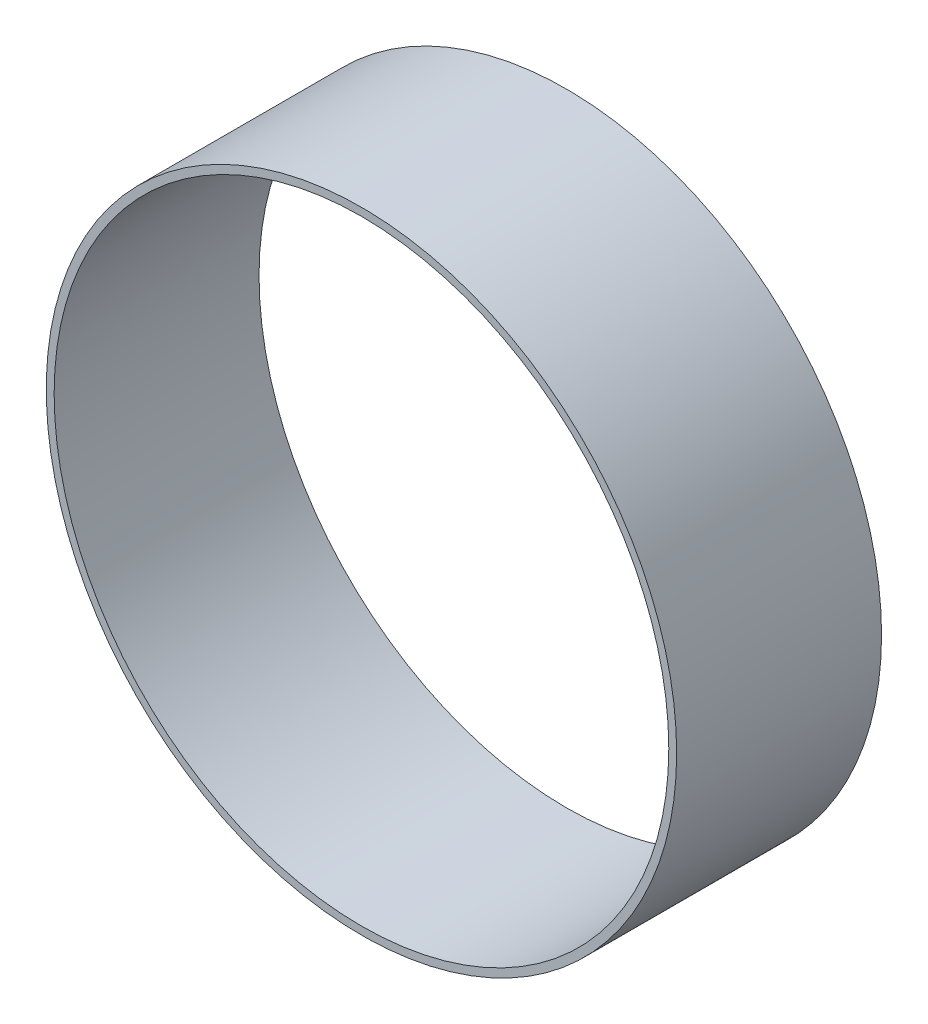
ISO-10303-21;
HEADER;
FILE_DESCRIPTION(('STEP AP214'),'2;1');
FILE_NAME('part.step','',(''),(''),'','','');
FILE_SCHEMA(('AUTOMOTIVE_DESIGN { 1 0 10303 214 1 1 1 1 }'));
ENDSEC;
DATA;
#1=APPLICATION_CONTEXT('core data for automotive mechanical design processes');
#2=APPLICATION_PROTOCOL_DEFINITION('international standard','automotive_design',2000,#1);
#3=PRODUCT_CONTEXT('',#1,'mechanical');
#4=PRODUCT('Part','Part','',(#3));
#5=PRODUCT_RELATED_PRODUCT_CATEGORY('part','',(#4));
#6=PRODUCT_DEFINITION_FORMATION('','',#4);
#7=PRODUCT_DEFINITION_CONTEXT('part definition',#1,'design');
#8=PRODUCT_DEFINITION('design','',#6,#7);
#9=PRODUCT_DEFINITION_SHAPE('','',#8);
#10=(LENGTH_UNIT() NAMED_UNIT(*) SI_UNIT(.MILLI.,.METRE.));
#11=(NAMED_UNIT(*) PLANE_ANGLE_UNIT() SI_UNIT($,.RADIAN.));
#12=(NAMED_UNIT(*) SI_UNIT($,.STERADIAN.) SOLID_ANGLE_UNIT());
#13=UNCERTAINTY_MEASURE_WITH_UNIT(LENGTH_MEASURE(1.E-05),#10,'distance_accuracy_value','');
#14=(GEOMETRIC_REPRESENTATION_CONTEXT(3) GLOBAL_UNCERTAINTY_ASSIGNED_CONTEXT((#13)) GLOBAL_UNIT_ASSIGNED_CONTEXT((#10,
#11,#12)) REPRESENTATION_CONTEXT('',''));
#15=CARTESIAN_POINT('',(0.,0.,0.));
#16=DIRECTION('',(0.,0.,1.));
#17=DIRECTION('',(1.,0.,0.));
#18=AXIS2_PLACEMENT_3D('',#15,#16,#17);
#19=CARTESIAN_POINT('',(0.,0.,82.55));
#20=DIRECTION('',(0.,0.,1.));
#21=DIRECTION('',(1.,0.,0.));
#22=AXIS2_PLACEMENT_3D('',#19,#20,#21);
#23=PLANE('',#22);
#24=CARTESIAN_POINT('',(0.,0.,82.55));
#25=DIRECTION('',(0.,0.,1.));
#26=DIRECTION('',(1.,0.,0.));
#27=AXIS2_PLACEMENT_3D('',#24,#25,#26);
#28=CIRCLE('',#27,127.);
#29=CARTESIAN_POINT('',(127.,0.,82.55));
#30=VERTEX_POINT('',#29);
#31=EDGE_CURVE('E10',#30,#30,#28,.T.);
#32=ORIENTED_EDGE('',*,*,#31,.T.);
#33=EDGE_LOOP('',(#32));
#34=FACE_BOUND('',#33,.T.);
#35=CARTESIAN_POINT('',(0.,0.,82.55));
#36=DIRECTION('',(0.,0.,1.));
#37=DIRECTION('',(1.,0.,0.));
#38=AXIS2_PLACEMENT_3D('',#35,#36,#37);
#39=CIRCLE('',#38,123.825);
#40=CARTESIAN_POINT('',(123.825,0.,82.55));
#41=VERTEX_POINT('',#40);
#42=EDGE_CURVE('E50',#41,#41,#39,.T.);
#43=ORIENTED_EDGE('',*,*,#42,.F.);
#44=EDGE_LOOP('',(#43));
#45=FACE_BOUND('',#44,.T.);
#46=ADVANCED_FACE('F37',(#34,#45),#23,.T.);
#47=CARTESIAN_POINT('',(0.,0.,0.));
#48=DIRECTION('',(0.,0.,1.));
#49=DIRECTION('',(1.,0.,0.));
#50=AXIS2_PLACEMENT_3D('',#47,#48,#49);
#51=PLANE('',#50);
#52=CARTESIAN_POINT('',(0.,0.,0.));
#53=DIRECTION('',(0.,0.,1.));
#54=DIRECTION('',(1.,0.,0.));
#55=AXIS2_PLACEMENT_3D('',#52,#53,#54);
#56=CIRCLE('',#55,127.);
#57=CARTESIAN_POINT('',(127.,0.,0.));
#58=VERTEX_POINT('',#57);
#59=EDGE_CURVE('E41',#58,#58,#56,.T.);
#60=ORIENTED_EDGE('',*,*,#59,.F.);
#61=EDGE_LOOP('',(#60));
#62=FACE_BOUND('',#61,.T.);
#63=CARTESIAN_POINT('',(0.,0.,0.));
#64=DIRECTION('',(0.,0.,1.));
#65=DIRECTION('',(1.,0.,0.));
#66=AXIS2_PLACEMENT_3D('',#63,#64,#65);
#67=CIRCLE('',#66,123.825);
#68=CARTESIAN_POINT('',(123.825,0.,0.));
#69=VERTEX_POINT('',#68);
#70=EDGE_CURVE('E52',#69,#69,#67,.T.);
#71=ORIENTED_EDGE('',*,*,#70,.T.);
#72=EDGE_LOOP('',(#71));
#73=FACE_BOUND('',#72,.T.);
#74=ADVANCED_FACE('F64',(#62,#73),#51,.F.);
#75=CARTESIAN_POINT('',(0.,0.,82.55));
#76=DIRECTION('',(0.,0.,-1.));
#77=DIRECTION('',(-1.,0.,0.));
#78=AXIS2_PLACEMENT_3D('',#75,#76,#77);
#79=CYLINDRICAL_SURFACE('',#78,127.);
#80=ORIENTED_EDGE('',*,*,#31,.F.);
#81=EDGE_LOOP('',(#80));
#82=FACE_BOUND('',#81,.T.);
#83=ORIENTED_EDGE('',*,*,#59,.T.);
#84=EDGE_LOOP('',(#83));
#85=FACE_BOUND('',#84,.T.);
#86=ADVANCED_FACE('F39',(#82,#85),#79,.T.);
#87=CARTESIAN_POINT('',(0.,0.,82.55));
#88=DIRECTION('',(0.,0.,-1.));
#89=DIRECTION('',(-1.,0.,0.));
#90=AXIS2_PLACEMENT_3D('',#87,#88,#89);
#91=CYLINDRICAL_SURFACE('',#90,123.825);
#92=ORIENTED_EDGE('',*,*,#42,.T.);
#93=EDGE_LOOP('',(#92));
#94=FACE_BOUND('',#93,.T.);
#95=ORIENTED_EDGE('',*,*,#70,.F.);
#96=EDGE_LOOP('',(#95));
#97=FACE_BOUND('',#96,.T.);
#98=ADVANCED_FACE('F60',(#94,#97),#91,.F.);
#99=CLOSED_SHELL('',(#46,#74,#86,#98));
#100=MANIFOLD_SOLID_BREP('B2',#99);
#101=ADVANCED_BREP_SHAPE_REPRESENTATION('',(#18,#100),#14);
#102=SHAPE_DEFINITION_REPRESENTATION(#9,#101);
ENDSEC;
END-ISO-10303-21;
